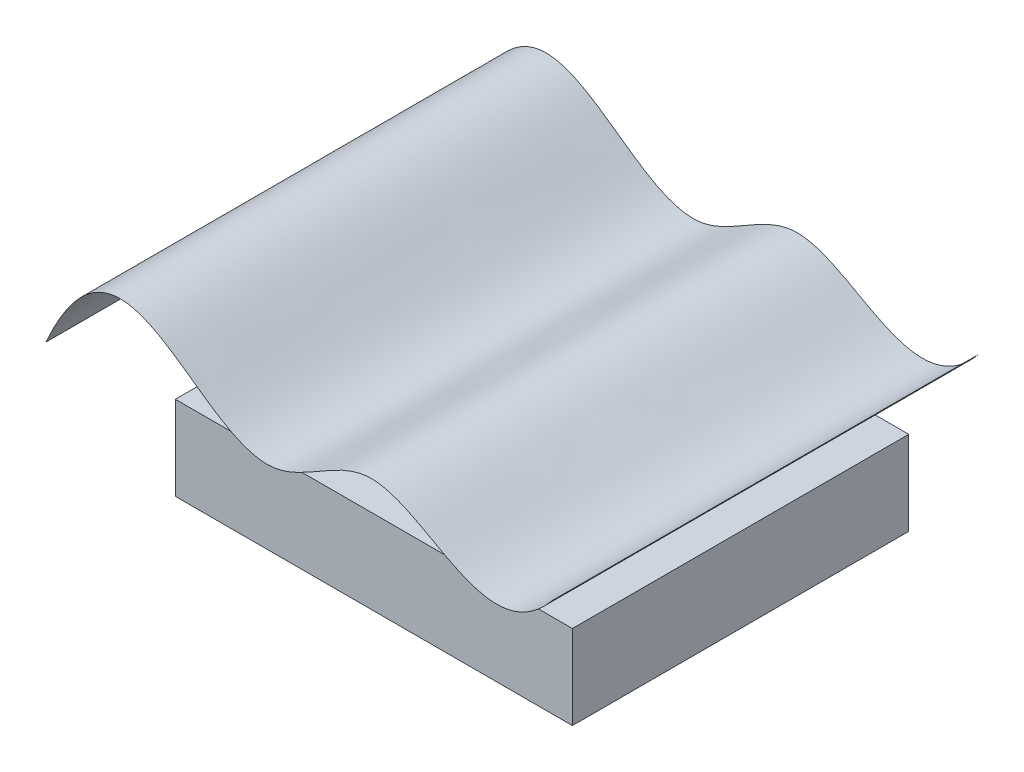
ISO-10303-21;
HEADER;
FILE_DESCRIPTION(('STEP AP214'),'2;1');
FILE_NAME('part.step','',(''),(''),'','','');
FILE_SCHEMA(('AUTOMOTIVE_DESIGN { 1 0 10303 214 1 1 1 1 }'));
ENDSEC;
DATA;
#1=APPLICATION_CONTEXT('core data for automotive mechanical design processes');
#2=APPLICATION_PROTOCOL_DEFINITION('international standard','automotive_design',2000,#1);
#3=PRODUCT_CONTEXT('',#1,'mechanical');
#4=PRODUCT('Part','Part','',(#3));
#5=PRODUCT_RELATED_PRODUCT_CATEGORY('part','',(#4));
#6=PRODUCT_DEFINITION_FORMATION('','',#4);
#7=PRODUCT_DEFINITION_CONTEXT('part definition',#1,'design');
#8=PRODUCT_DEFINITION('design','',#6,#7);
#9=PRODUCT_DEFINITION_SHAPE('','',#8);
#10=(LENGTH_UNIT() NAMED_UNIT(*) SI_UNIT(.MILLI.,.METRE.));
#11=(NAMED_UNIT(*) PLANE_ANGLE_UNIT() SI_UNIT($,.RADIAN.));
#12=(NAMED_UNIT(*) SI_UNIT($,.STERADIAN.) SOLID_ANGLE_UNIT());
#13=UNCERTAINTY_MEASURE_WITH_UNIT(LENGTH_MEASURE(1.E-05),#10,'distance_accuracy_value','');
#14=(GEOMETRIC_REPRESENTATION_CONTEXT(3) GLOBAL_UNCERTAINTY_ASSIGNED_CONTEXT((#13)) GLOBAL_UNIT_ASSIGNED_CONTEXT((#10,
#11,#12)) REPRESENTATION_CONTEXT('',''));
#15=CARTESIAN_POINT('',(0.,0.,0.));
#16=DIRECTION('',(0.,0.,1.));
#17=DIRECTION('',(1.,0.,0.));
#18=AXIS2_PLACEMENT_3D('',#15,#16,#17);
#19=CARTESIAN_POINT('',(-135.107834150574,54.2523762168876,-101.6));
#20=CARTESIAN_POINT('',(-99.3907083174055,135.36578264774,-101.6));
#21=CARTESIAN_POINT('',(-49.7777167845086,19.4803702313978,-101.6));
#22=CARTESIAN_POINT('',(31.2479090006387,103.273190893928,-101.6));
#23=CARTESIAN_POINT('',(74.6915904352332,30.0451414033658,-101.6));
#24=CARTESIAN_POINT('',(106.448596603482,68.1725773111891,-101.6));
#25=B_SPLINE_CURVE_WITH_KNOTS('',3,(#19,#20,#21,#22,#23,#24),.UNSPECIFIED.,.F.,.F.,(4,1,1,4),
(0.,0.466697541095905,0.647731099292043,1.),.UNSPECIFIED.);
#26=DIRECTION('',(0.,0.,1.));
#27=VECTOR('',#26,1.);
#28=SURFACE_OF_LINEAR_EXTRUSION('',#25,#27);
#29=CARTESIAN_POINT('',(-135.107834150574,54.2523762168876,101.6));
#30=CARTESIAN_POINT('',(-99.3907083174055,135.36578264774,101.6));
#31=CARTESIAN_POINT('',(-49.7777167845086,19.4803702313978,101.6));
#32=CARTESIAN_POINT('',(31.2479090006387,103.273190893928,101.6));
#33=CARTESIAN_POINT('',(74.6915904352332,30.0451414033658,101.6));
#34=CARTESIAN_POINT('',(106.448596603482,68.1725773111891,101.6));
#35=B_SPLINE_CURVE_WITH_KNOTS('',3,(#29,#30,#31,#32,#33,#34),.UNSPECIFIED.,.F.,.F.,(4,1,1,4),
(0.,0.466697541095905,0.647731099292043,1.),.UNSPECIFIED.);
#36=CARTESIAN_POINT('',(-135.107834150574,54.2523762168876,101.6));
#37=VERTEX_POINT('',#36);
#38=CARTESIAN_POINT('',(106.448596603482,68.1725773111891,101.6));
#39=VERTEX_POINT('',#38);
#40=EDGE_CURVE('E69',#37,#39,#35,.T.);
#41=ORIENTED_EDGE('',*,*,#40,.F.);
#42=DIRECTION('',(0.,0.,1.));
#43=VECTOR('',#42,1.);
#44=CARTESIAN_POINT('',(-135.107834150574,54.2523762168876,-101.6));
#45=LINE('',#44,#43);
#46=CARTESIAN_POINT('',(-135.107834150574,54.2523762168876,-101.6));
#47=VERTEX_POINT('',#46);
#48=EDGE_CURVE('E51',#47,#37,#45,.T.);
#49=ORIENTED_EDGE('',*,*,#48,.F.);
#50=CARTESIAN_POINT('',(106.448596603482,68.1725773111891,-101.6));
#51=VERTEX_POINT('',#50);
#52=EDGE_CURVE('E57',#47,#51,#25,.T.);
#53=ORIENTED_EDGE('',*,*,#52,.T.);
#54=DIRECTION('',(0.,0.,1.));
#55=VECTOR('',#54,1.);
#56=CARTESIAN_POINT('',(106.448596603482,68.1725773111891,-101.6));
#57=LINE('',#56,#55);
#58=EDGE_CURVE('E12',#51,#39,#57,.T.);
#59=ORIENTED_EDGE('',*,*,#58,.T.);
#60=EDGE_LOOP('',(#41,#49,#53,#59));
#61=FACE_BOUND('',#60,.T.);
#62=ADVANCED_FACE('F49',(#61),#28,.T.);
#63=OPEN_SHELL('',(#62));
#64=SHELL_BASED_SURFACE_MODEL('B2',(#63));
#65=CARTESIAN_POINT('',(94.7449071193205,40.132,80.2493362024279));
#66=DIRECTION('',(-1.,0.,0.));
#67=DIRECTION('',(0.,0.,1.));
#68=AXIS2_PLACEMENT_3D('',#65,#66,#67);
#69=PLANE('',#68);
#70=DIRECTION('',(0.,0.,-1.));
#71=VECTOR('',#70,1.);
#72=CARTESIAN_POINT('',(94.7449071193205,0.,80.2493362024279));
#73=LINE('',#72,#71);
#74=CARTESIAN_POINT('',(94.7449071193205,0.,80.2493362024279));
#75=VERTEX_POINT('',#74);
#76=CARTESIAN_POINT('',(94.7449071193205,0.,-80.2493362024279));
#77=VERTEX_POINT('',#76);
#78=EDGE_CURVE('E180',#75,#77,#73,.T.);
#79=ORIENTED_EDGE('',*,*,#78,.T.);
#80=DIRECTION('',(0.,-1.,0.));
#81=VECTOR('',#80,1.);
#82=CARTESIAN_POINT('',(94.7449071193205,40.132,-80.2493362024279));
#83=LINE('',#82,#81);
#84=CARTESIAN_POINT('',(94.7449071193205,40.132,-80.2493362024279));
#85=VERTEX_POINT('',#84);
#86=EDGE_CURVE('E47',#85,#77,#83,.T.);
#87=ORIENTED_EDGE('',*,*,#86,.F.);
#88=DIRECTION('',(0.,0.,-1.));
#89=VECTOR('',#88,1.);
#90=CARTESIAN_POINT('',(94.7449071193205,40.132,80.2493362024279));
#91=LINE('',#90,#89);
#92=CARTESIAN_POINT('',(94.7449071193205,40.132,80.2493362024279));
#93=VERTEX_POINT('',#92);
#94=EDGE_CURVE('E168',#93,#85,#91,.T.);
#95=ORIENTED_EDGE('',*,*,#94,.F.);
#96=DIRECTION('',(0.,-1.,0.));
#97=VECTOR('',#96,1.);
#98=CARTESIAN_POINT('',(94.7449071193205,40.132,80.2493362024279));
#99=LINE('',#98,#97);
#100=EDGE_CURVE('E176',#93,#75,#99,.T.);
#101=ORIENTED_EDGE('',*,*,#100,.T.);
#102=EDGE_LOOP('',(#79,#87,#95,#101));
#103=FACE_BOUND('',#102,.T.);
#104=ADVANCED_FACE('F117',(#103),#69,.F.);
#105=CARTESIAN_POINT('',(-94.7449071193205,40.132,-80.2493362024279));
#106=DIRECTION('',(0.,0.,1.));
#107=DIRECTION('',(1.,0.,0.));
#108=AXIS2_PLACEMENT_3D('',#105,#106,#107);
#109=PLANE('',#108);
#110=DIRECTION('',(-1.,0.,0.));
#111=VECTOR('',#110,1.);
#112=CARTESIAN_POINT('',(-94.7449071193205,0.,-80.2493362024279));
#113=LINE('',#112,#111);
#114=CARTESIAN_POINT('',(-94.7449071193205,0.,-80.2493362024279));
#115=VERTEX_POINT('',#114);
#116=EDGE_CURVE('E172',#77,#115,#113,.T.);
#117=ORIENTED_EDGE('',*,*,#116,.T.);
#118=DIRECTION('',(0.,-1.,0.));
#119=VECTOR('',#118,1.);
#120=CARTESIAN_POINT('',(-94.7449071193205,40.132,-80.2493362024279));
#121=LINE('',#120,#119);
#122=CARTESIAN_POINT('',(-94.7449071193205,40.132,-80.2493362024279));
#123=VERTEX_POINT('',#122);
#124=EDGE_CURVE('E125',#123,#115,#121,.T.);
#125=ORIENTED_EDGE('',*,*,#124,.F.);
#126=DIRECTION('',(-1.,0.,0.));
#127=VECTOR('',#126,1.);
#128=CARTESIAN_POINT('',(-94.7449071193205,40.132,-80.2493362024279));
#129=LINE('',#128,#127);
#130=EDGE_CURVE('E163',#85,#123,#129,.T.);
#131=ORIENTED_EDGE('',*,*,#130,.F.);
#132=ORIENTED_EDGE('',*,*,#86,.T.);
#133=EDGE_LOOP('',(#117,#125,#131,#132));
#134=FACE_BOUND('',#133,.T.);
#135=ADVANCED_FACE('F171',(#134),#109,.F.);
#136=CARTESIAN_POINT('',(-94.7449071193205,40.132,80.2493362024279));
#137=DIRECTION('',(1.,0.,0.));
#138=DIRECTION('',(0.,0.,-1.));
#139=AXIS2_PLACEMENT_3D('',#136,#137,#138);
#140=PLANE('',#139);
#141=DIRECTION('',(0.,0.,1.));
#142=VECTOR('',#141,1.);
#143=CARTESIAN_POINT('',(-94.7449071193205,0.,80.2493362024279));
#144=LINE('',#143,#142);
#145=CARTESIAN_POINT('',(-94.7449071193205,0.,80.2493362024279));
#146=VERTEX_POINT('',#145);
#147=EDGE_CURVE('E150',#115,#146,#144,.T.);
#148=ORIENTED_EDGE('',*,*,#147,.T.);
#149=DIRECTION('',(0.,-1.,0.));
#150=VECTOR('',#149,1.);
#151=CARTESIAN_POINT('',(-94.7449071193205,40.132,80.2493362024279));
#152=LINE('',#151,#150);
#153=CARTESIAN_POINT('',(-94.7449071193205,40.132,80.2493362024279));
#154=VERTEX_POINT('',#153);
#155=EDGE_CURVE('E173',#154,#146,#152,.T.);
#156=ORIENTED_EDGE('',*,*,#155,.F.);
#157=DIRECTION('',(0.,0.,1.));
#158=VECTOR('',#157,1.);
#159=CARTESIAN_POINT('',(-94.7449071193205,40.132,80.2493362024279));
#160=LINE('',#159,#158);
#161=EDGE_CURVE('E166',#123,#154,#160,.T.);
#162=ORIENTED_EDGE('',*,*,#161,.F.);
#163=ORIENTED_EDGE('',*,*,#124,.T.);
#164=EDGE_LOOP('',(#148,#156,#162,#163));
#165=FACE_BOUND('',#164,.T.);
#166=ADVANCED_FACE('F174',(#165),#140,.F.);
#167=CARTESIAN_POINT('',(-94.7449071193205,40.132,80.2493362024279));
#168=DIRECTION('',(0.,0.,-1.));
#169=DIRECTION('',(-1.,0.,0.));
#170=AXIS2_PLACEMENT_3D('',#167,#168,#169);
#171=PLANE('',#170);
#172=DIRECTION('',(1.,0.,0.));
#173=VECTOR('',#172,1.);
#174=CARTESIAN_POINT('',(-94.7449071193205,0.,80.2493362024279));
#175=LINE('',#174,#173);
#176=EDGE_CURVE('E156',#146,#75,#175,.T.);
#177=ORIENTED_EDGE('',*,*,#176,.T.);
#178=ORIENTED_EDGE('',*,*,#100,.F.);
#179=DIRECTION('',(1.,0.,0.));
#180=VECTOR('',#179,1.);
#181=CARTESIAN_POINT('',(-94.7449071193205,40.132,80.2493362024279));
#182=LINE('',#181,#180);
#183=EDGE_CURVE('E133',#154,#93,#182,.T.);
#184=ORIENTED_EDGE('',*,*,#183,.F.);
#185=ORIENTED_EDGE('',*,*,#155,.T.);
#186=EDGE_LOOP('',(#177,#178,#184,#185));
#187=FACE_BOUND('',#186,.T.);
#188=ADVANCED_FACE('F187',(#187),#171,.F.);
#189=CARTESIAN_POINT('',(0.,40.132,0.));
#190=DIRECTION('',(0.,-1.,0.));
#191=DIRECTION('',(0.,0.,-1.));
#192=AXIS2_PLACEMENT_3D('',#189,#190,#191);
#193=PLANE('',#192);
#194=ORIENTED_EDGE('',*,*,#94,.T.);
#195=ORIENTED_EDGE('',*,*,#130,.T.);
#196=ORIENTED_EDGE('',*,*,#161,.T.);
#197=ORIENTED_EDGE('',*,*,#183,.T.);
#198=EDGE_LOOP('',(#194,#195,#196,#197));
#199=FACE_BOUND('',#198,.T.);
#200=ADVANCED_FACE('F164',(#199),#193,.F.);
#201=CARTESIAN_POINT('',(0.,0.,0.));
#202=DIRECTION('',(0.,-1.,0.));
#203=DIRECTION('',(0.,0.,-1.));
#204=AXIS2_PLACEMENT_3D('',#201,#202,#203);
#205=PLANE('',#204);
#206=ORIENTED_EDGE('',*,*,#78,.F.);
#207=ORIENTED_EDGE('',*,*,#176,.F.);
#208=ORIENTED_EDGE('',*,*,#147,.F.);
#209=ORIENTED_EDGE('',*,*,#116,.F.);
#210=EDGE_LOOP('',(#206,#207,#208,#209));
#211=FACE_BOUND('',#210,.T.);
#212=ADVANCED_FACE('F190',(#211),#205,.T.);
#213=CLOSED_SHELL('',(#104,#135,#166,#188,#200,#212));
#214=MANIFOLD_SOLID_BREP('B6',#213);
#215=ADVANCED_BREP_SHAPE_REPRESENTATION('',(#18,#214),#14);
#216=MANIFOLD_SURFACE_SHAPE_REPRESENTATION('',(#18,#64),#14);
#217=SHAPE_REPRESENTATION('',(#18),#14);
#218=SHAPE_DEFINITION_REPRESENTATION(#9,#217);
#219=SHAPE_REPRESENTATION_RELATIONSHIP('','',#217,#215);
#220=SHAPE_REPRESENTATION_RELATIONSHIP('','',#217,#216);
ENDSEC;
END-ISO-10303-21;
